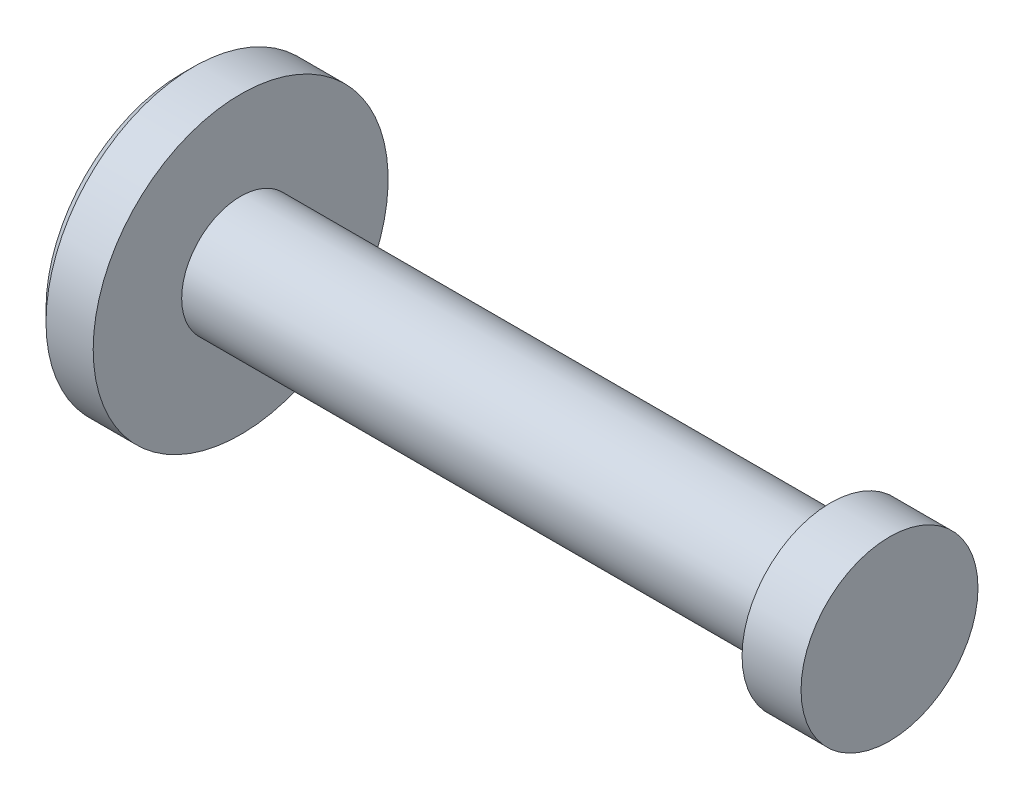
from build123d import *

# Parameters (mm, degrees)
CHANFREIN2_SIZE = 0.2


with BuildPart() as part:
    # Esquisse1 → Base-R_volution (revolve)
    with BuildSketch(Plane.XY, mode=Mode.PRIVATE) as base_r_volution_sk:
        Polygon((0, 0), (0, -1.5), (-1, -1.5), (-1, -1), (-11, -1), (-11, -2.5), (-12, -2.5), (-12, 0), align=None)
    revolve(base_r_volution_sk.sketch.rotate(Axis((-90, 0, 0), (1, 0, 0)), 270), axis=Axis((-90, 0, 0), (1, 0, 0)))

    # Chanfrein2
    chanfrein2_edges = [part.edges().sort_by_distance(p)[0] for p in [
        (-12, 0, -2.5),
    ]]
    chamfer(chanfrein2_edges, length=CHANFREIN2_SIZE)


solid = part.part
